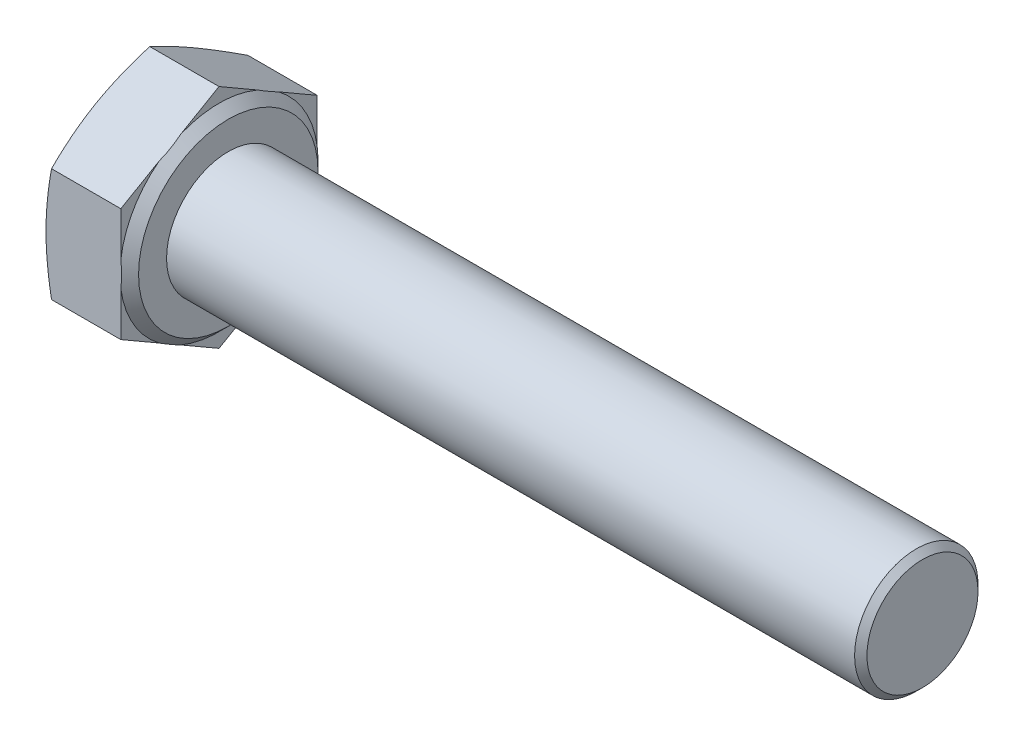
ISO-10303-21;
HEADER;
FILE_DESCRIPTION(('STEP AP214'),'2;1');
FILE_NAME('part.step','',(''),(''),'','','');
FILE_SCHEMA(('AUTOMOTIVE_DESIGN { 1 0 10303 214 1 1 1 1 }'));
ENDSEC;
DATA;
#1=APPLICATION_CONTEXT('core data for automotive mechanical design processes');
#2=APPLICATION_PROTOCOL_DEFINITION('international standard','automotive_design',2000,#1);
#3=PRODUCT_CONTEXT('',#1,'mechanical');
#4=PRODUCT('Part','Part','',(#3));
#5=PRODUCT_RELATED_PRODUCT_CATEGORY('part','',(#4));
#6=PRODUCT_DEFINITION_FORMATION('','',#4);
#7=PRODUCT_DEFINITION_CONTEXT('part definition',#1,'design');
#8=PRODUCT_DEFINITION('design','',#6,#7);
#9=PRODUCT_DEFINITION_SHAPE('','',#8);
#10=(LENGTH_UNIT() NAMED_UNIT(*) SI_UNIT(.MILLI.,.METRE.));
#11=(NAMED_UNIT(*) PLANE_ANGLE_UNIT() SI_UNIT($,.RADIAN.));
#12=(NAMED_UNIT(*) SI_UNIT($,.STERADIAN.) SOLID_ANGLE_UNIT());
#13=UNCERTAINTY_MEASURE_WITH_UNIT(LENGTH_MEASURE(1.E-05),#10,'distance_accuracy_value','');
#14=(GEOMETRIC_REPRESENTATION_CONTEXT(3) GLOBAL_UNCERTAINTY_ASSIGNED_CONTEXT((#13)) GLOBAL_UNIT_ASSIGNED_CONTEXT((#10,
#11,#12)) REPRESENTATION_CONTEXT('',''));
#15=CARTESIAN_POINT('',(0.,0.,0.));
#16=DIRECTION('',(0.,0.,1.));
#17=DIRECTION('',(1.,0.,0.));
#18=AXIS2_PLACEMENT_3D('',#15,#16,#17);
#19=CARTESIAN_POINT('',(5.45,-3.67483446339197,-6.365));
#20=DIRECTION('',(1.,0.,0.));
#21=DIRECTION('',(0.,0.,-1.));
#22=AXIS2_PLACEMENT_3D('',#19,#20,#21);
#23=PLANE('',#22);
#24=CARTESIAN_POINT('',(5.45,0.,0.));
#25=DIRECTION('',(-1.,0.,0.));
#26=DIRECTION('',(0.,0.,1.));
#27=AXIS2_PLACEMENT_3D('',#24,#25,#26);
#28=CIRCLE('',#27,5.815);
#29=CARTESIAN_POINT('',(5.45,0.,5.815));
#30=VERTEX_POINT('',#29);
#31=EDGE_CURVE('E342',#30,#30,#28,.T.);
#32=ORIENTED_EDGE('',*,*,#31,.F.);
#33=EDGE_LOOP('',(#32));
#34=FACE_BOUND('',#33,.T.);
#35=CARTESIAN_POINT('',(5.45,0.,0.));
#36=DIRECTION('',(1.,0.,0.));
#37=DIRECTION('',(0.,0.,-1.));
#38=AXIS2_PLACEMENT_3D('',#35,#36,#37);
#39=CIRCLE('',#38,4.);
#40=CARTESIAN_POINT('',(5.45,0.,4.));
#41=VERTEX_POINT('',#40);
#42=EDGE_CURVE('E345',#41,#41,#39,.T.);
#43=ORIENTED_EDGE('',*,*,#42,.F.);
#44=EDGE_LOOP('',(#43));
#45=FACE_BOUND('',#44,.T.);
#46=ADVANCED_FACE('F30',(#34,#45),#23,.T.);
#47=CARTESIAN_POINT('',(5.45,-7.34966892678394,0.));
#48=DIRECTION('',(0.,0.866025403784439,0.5));
#49=DIRECTION('',(0.,-0.5,0.866025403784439));
#50=AXIS2_PLACEMENT_3D('',#47,#48,#49);
#51=PLANE('',#50);
#52=CARTESIAN_POINT('',(0.358432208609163,-3.67471899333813,-6.3652));
#53=CARTESIAN_POINT('',(0.303017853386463,-3.82691148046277,-6.10159487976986));
#54=CARTESIAN_POINT('',(0.252608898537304,-3.9796058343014,-5.83712050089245));
#55=CARTESIAN_POINT('',(0.163922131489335,-4.28598738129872,-5.30645209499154));
#56=CARTESIAN_POINT('',(0.125653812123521,-4.43967525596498,-5.0402568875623));
#57=CARTESIAN_POINT('',(0.0637558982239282,-4.74633825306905,-4.50910099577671));
#58=CARTESIAN_POINT('',(0.0399912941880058,-4.8993063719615,-4.24415244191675));
#59=CARTESIAN_POINT('',(0.00811628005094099,-5.2056003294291,-3.71363574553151));
#60=CARTESIAN_POINT('',(0.,-5.35892601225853,-3.44806787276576));
#61=CARTESIAN_POINT('',(0.,-5.66557737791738,-2.91693212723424));
#62=CARTESIAN_POINT('',(0.00811628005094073,-5.81890306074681,-2.65136425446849));
#63=CARTESIAN_POINT('',(0.0399912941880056,-6.12519701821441,-2.12084755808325));
#64=CARTESIAN_POINT('',(0.0637558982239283,-6.27816513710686,-1.85589900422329));
#65=CARTESIAN_POINT('',(0.125653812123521,-6.58482813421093,-1.3247431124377));
#66=CARTESIAN_POINT('',(0.163922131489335,-6.73851600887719,-1.05854790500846));
#67=CARTESIAN_POINT('',(0.252608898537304,-7.04489755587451,-0.527879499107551));
#68=CARTESIAN_POINT('',(0.303017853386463,-7.19759190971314,-0.263405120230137));
#69=CARTESIAN_POINT('',(0.358432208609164,-7.34978439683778,0.000200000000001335));
#70=B_SPLINE_CURVE_WITH_KNOTS('',3,(#52,#53,#54,#55,#56,#57,#58,#59,#60,#61,#62,#63,#64,#65,#66,
#67,#68,#69),.UNSPECIFIED.,.F.,.F.,(4,2,2,2,2,2,2,2,4),(0.,0.928259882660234,1.85724379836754,
2.77744274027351,3.69729643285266,4.6171501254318,5.53734906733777,6.46633298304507,
7.39459286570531),.UNSPECIFIED.);
#71=CARTESIAN_POINT('',(0.358390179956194,-3.67483446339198,-6.365));
#72=VERTEX_POINT('',#71);
#73=CARTESIAN_POINT('',(0.,-5.51225169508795,-3.1825));
#74=VERTEX_POINT('',#73);
#75=EDGE_CURVE('E144',#72,#74,#70,.T.);
#76=ORIENTED_EDGE('',*,*,#75,.F.);
#77=DIRECTION('',(-1.,0.,0.));
#78=VECTOR('',#77,1.);
#79=CARTESIAN_POINT('',(5.45,-3.67483446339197,-6.365));
#80=LINE('',#79,#78);
#81=CARTESIAN_POINT('',(4.85,-3.67483446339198,-6.365));
#82=VERTEX_POINT('',#81);
#83=EDGE_CURVE('E173',#82,#72,#80,.T.);
#84=ORIENTED_EDGE('',*,*,#83,.F.);
#85=DIRECTION('',(0.,0.5,-0.866025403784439));
#86=VECTOR('',#85,1.);
#87=CARTESIAN_POINT('',(4.85,-7.34966892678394,0.));
#88=LINE('',#87,#86);
#89=CARTESIAN_POINT('',(4.85,-5.11256431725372,-3.87477884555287));
#90=VERTEX_POINT('',#89);
#91=EDGE_CURVE('E382',#90,#82,#88,.T.);
#92=ORIENTED_EDGE('',*,*,#91,.F.);
#93=CARTESIAN_POINT('',(4.8498,-5.91274078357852,-2.48883255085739));
#94=CARTESIAN_POINT('',(4.86645104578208,-5.84620990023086,-2.60406742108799));
#95=CARTESIAN_POINT('',(4.8790176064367,-5.77941769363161,-2.71975491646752));
#96=CARTESIAN_POINT('',(4.8957758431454,-5.64583354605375,-2.95112944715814));
#97=CARTESIAN_POINT('',(4.9,-5.57904262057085,-3.06681472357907));
#98=CARTESIAN_POINT('',(4.9,-5.44546076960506,-3.29818527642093));
#99=CARTESIAN_POINT('',(4.8957758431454,-5.37866984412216,-3.41387055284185));
#100=CARTESIAN_POINT('',(4.8790176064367,-5.2450856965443,-3.64524508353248));
#101=CARTESIAN_POINT('',(4.86645104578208,-5.17829348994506,-3.76093257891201));
#102=CARTESIAN_POINT('',(4.8498,-5.11176260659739,-3.87616744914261));
#103=B_SPLINE_CURVE_WITH_KNOTS('',3,(#93,#94,#95,#96,#97,#98,#99,#100,#101,#102),.UNSPECIFIED.,
.F.,.F.,(4,2,2,2,4),(0.,0.402253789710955,0.802938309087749,1.20362282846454,1.6058766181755),.UNSPECIFIED.);
#104=CARTESIAN_POINT('',(4.85,-5.91193907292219,-2.49022115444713));
#105=VERTEX_POINT('',#104);
#106=EDGE_CURVE('E279',#105,#90,#103,.T.);
#107=ORIENTED_EDGE('',*,*,#106,.F.);
#108=CARTESIAN_POINT('',(4.85,-7.34966892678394,0.));
#109=VERTEX_POINT('',#108);
#110=EDGE_CURVE('E387',#109,#105,#88,.T.);
#111=ORIENTED_EDGE('',*,*,#110,.F.);
#112=DIRECTION('',(-1.,0.,0.));
#113=VECTOR('',#112,1.);
#114=CARTESIAN_POINT('',(5.45,-7.34966892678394,0.));
#115=LINE('',#114,#113);
#116=CARTESIAN_POINT('',(0.358390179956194,-7.34966892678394,0.));
#117=VERTEX_POINT('',#116);
#118=EDGE_CURVE('E167',#109,#117,#115,.T.);
#119=ORIENTED_EDGE('',*,*,#118,.T.);
#120=EDGE_CURVE('E198',#74,#117,#70,.T.);
#121=ORIENTED_EDGE('',*,*,#120,.F.);
#122=EDGE_LOOP('',(#76,#84,#92,#107,#111,#119,#121));
#123=FACE_BOUND('',#122,.T.);
#124=ADVANCED_FACE('F213',(#123),#51,.F.);
#125=CARTESIAN_POINT('',(5.45,-3.67483446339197,-6.365));
#126=DIRECTION('',(0.,0.,1.));
#127=DIRECTION('',(0.,-1.,0.));
#128=AXIS2_PLACEMENT_3D('',#125,#126,#127);
#129=PLANE('',#128);
#130=CARTESIAN_POINT('',(1.9150953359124,-9.72967062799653,-6.365));
#131=CARTESIAN_POINT('',(1.82740685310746,-9.44169496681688,-6.365));
#132=CARTESIAN_POINT('',(1.74074158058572,-9.15340194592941,-6.365));
#133=CARTESIAN_POINT('',(1.57002349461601,-8.57601961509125,-6.365));
#134=CARTESIAN_POINT('',(1.48597088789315,-8.28693024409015,-6.365));
#135=CARTESIAN_POINT('',(1.320904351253,-7.70729883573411,-6.365));
#136=CARTESIAN_POINT('',(1.23989638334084,-7.41675509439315,-6.365));
#137=CARTESIAN_POINT('',(1.08186750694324,-6.83458682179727,-6.365));
#138=CARTESIAN_POINT('',(1.0048465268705,-6.54296231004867,-6.365));
#139=CARTESIAN_POINT('',(0.856698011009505,-5.96204179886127,-6.365));
#140=CARTESIAN_POINT('',(0.785509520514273,-5.67276142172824,-6.365));
#141=CARTESIAN_POINT('',(0.64919338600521,-5.09276117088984,-6.365));
#142=CARTESIAN_POINT('',(0.584065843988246,-4.80204127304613,-6.365));
#143=CARTESIAN_POINT('',(0.46138999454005,-4.21909692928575,-6.365));
#144=CARTESIAN_POINT('',(0.40383910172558,-3.92687303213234,-6.365));
#145=CARTESIAN_POINT('',(0.298068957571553,-3.34072867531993,-6.365));
#146=CARTESIAN_POINT('',(0.249849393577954,-3.04680827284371,-6.365));
#147=CARTESIAN_POINT('',(0.169475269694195,-2.49036754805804,-6.365));
#148=CARTESIAN_POINT('',(0.136125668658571,-2.22802146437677,-6.365));
#149=CARTESIAN_POINT('',(0.0796727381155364,-1.70221996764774,-6.365));
#150=CARTESIAN_POINT('',(0.0565691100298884,-1.43876458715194,-6.365));
#151=CARTESIAN_POINT('',(0.0217207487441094,-0.911278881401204,-6.365));
#152=CARTESIAN_POINT('',(0.00996798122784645,-0.64724909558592,-6.365));
#153=CARTESIAN_POINT('',(-0.00158361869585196,-0.11892536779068,-6.365));
#154=CARTESIAN_POINT('',(-0.00138253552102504,0.145368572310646,-6.365));
#155=CARTESIAN_POINT('',(0.0109939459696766,0.675012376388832,-6.365));
#156=CARTESIAN_POINT('',(0.0232300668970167,0.940360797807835,-6.365));
#157=CARTESIAN_POINT('',(0.0591135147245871,1.47027824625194,-6.365));
#158=CARTESIAN_POINT('',(0.0827611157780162,1.73484725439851,-6.365));
#159=CARTESIAN_POINT('',(0.14036130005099,2.26307523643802,-6.365));
#160=CARTESIAN_POINT('',(0.174322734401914,2.52673323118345,-6.365));
#161=CARTESIAN_POINT('',(0.251173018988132,3.0527302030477,-6.365));
#162=CARTESIAN_POINT('',(0.294061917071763,3.31506917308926,-6.365));
#163=CARTESIAN_POINT('',(0.389839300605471,3.85223310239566,-6.365));
#164=CARTESIAN_POINT('',(0.443136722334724,4.12698449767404,-6.365));
#165=CARTESIAN_POINT('',(0.556591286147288,4.67507636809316,-6.365));
#166=CARTESIAN_POINT('',(0.616748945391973,4.94841673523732,-6.365));
#167=CARTESIAN_POINT('',(0.742660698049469,5.49388136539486,-6.365));
#168=CARTESIAN_POINT('',(0.808416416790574,5.7660052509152,-6.365));
#169=CARTESIAN_POINT('',(0.944454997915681,6.30910658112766,-6.365));
#170=CARTESIAN_POINT('',(1.01473775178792,6.58008405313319,-6.365));
#171=CARTESIAN_POINT('',(1.15907513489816,7.1214003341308,-6.365));
#172=CARTESIAN_POINT('',(1.23313447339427,7.39173788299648,-6.365));
#173=CARTESIAN_POINT('',(1.38427063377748,7.93156975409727,-6.365));
#174=CARTESIAN_POINT('',(1.46134750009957,8.20106406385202,-6.365));
#175=CARTESIAN_POINT('',(1.69623888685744,9.00837522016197,-6.365));
#176=CARTESIAN_POINT('',(1.85774082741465,9.5451184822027,-6.365));
#177=CARTESIAN_POINT('',(2.18566531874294,10.6106004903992,-6.365));
#178=CARTESIAN_POINT('',(2.35201388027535,11.1393621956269,-6.365));
#179=CARTESIAN_POINT('',(2.68943698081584,12.1954003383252,-6.365));
#180=CARTESIAN_POINT('',(2.86051174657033,12.7226767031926,-6.365));
#181=CARTESIAN_POINT('',(3.20545948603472,13.7740950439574,-6.365));
#182=CARTESIAN_POINT('',(3.37931937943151,14.298241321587,-6.365));
#183=CARTESIAN_POINT('',(3.64203864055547,15.0837906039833,-6.365));
#184=CARTESIAN_POINT('',(3.72992971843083,15.3455181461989,-6.365));
#185=CARTESIAN_POINT('',(3.90628058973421,15.8687808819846,-6.365));
#186=CARTESIAN_POINT('',(3.99474038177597,16.1303160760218,-6.365));
#187=CARTESIAN_POINT('',(4.08344640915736,16.3917677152,-6.365));
#188=B_SPLINE_CURVE_WITH_KNOTS('',3,(#130,#131,#132,#133,#134,#135,#136,#137,#138,#139,#140,
#141,#142,#143,#144,#145,#146,#147,#148,#149,#150,#151,#152,#153,#154,#155,#156,#157,#158,#159,
#160,#161,#162,#163,#164,#165,#166,#167,#168,#169,#170,#171,#172,#173,#174,#175,#176,#177,#178,
#179,#180,#181,#182,#183,#184,#185,#186,#187),.UNSPECIFIED.,.F.,.F.,(4,2,2,2,2,2,2,2,2,2,2,2,2,
2,2,2,2,2,2,2,2,2,2,2,2,2,2,2,4),(0.,0.903097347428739,1.8062659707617,2.7111196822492,
3.61595714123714,4.50963841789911,5.4033347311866,6.29672529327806,7.19008591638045,
7.98328363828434,8.77645824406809,9.56907101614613,10.361678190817,11.1583050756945,
11.9549510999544,12.7522827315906,13.5496186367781,14.3891305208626,15.2287057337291,
16.0685255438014,16.9083252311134,17.7491990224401,18.5900852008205,20.271552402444,
21.9344598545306,23.5974472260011,25.2541246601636,26.0823966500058,26.9106666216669),.UNSPECIFIED.);
#189=CARTESIAN_POINT('',(0.358390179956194,3.67483446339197,-6.36500000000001));
#190=VERTEX_POINT('',#189);
#191=CARTESIAN_POINT('',(0.,0.,-6.365));
#192=VERTEX_POINT('',#191);
#193=EDGE_CURVE('E258',#190,#192,#188,.F.);
#194=ORIENTED_EDGE('',*,*,#193,.F.);
#195=DIRECTION('',(-1.,0.,0.));
#196=VECTOR('',#195,1.);
#197=CARTESIAN_POINT('',(5.45,3.67483446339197,-6.365));
#198=LINE('',#197,#196);
#199=CARTESIAN_POINT('',(4.85,3.67483446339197,-6.365));
#200=VERTEX_POINT('',#199);
#201=EDGE_CURVE('E164',#200,#190,#198,.T.);
#202=ORIENTED_EDGE('',*,*,#201,.F.);
#203=DIRECTION('',(0.,1.,0.));
#204=VECTOR('',#203,1.);
#205=CARTESIAN_POINT('',(4.85,-3.67483446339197,-6.365));
#206=LINE('',#205,#204);
#207=CARTESIAN_POINT('',(4.85,0.7993747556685,-6.365));
#208=VERTEX_POINT('',#207);
#209=EDGE_CURVE('E388',#208,#200,#206,.T.);
#210=ORIENTED_EDGE('',*,*,#209,.F.);
#211=CARTESIAN_POINT('',(4.03279951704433,-3.43387519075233,-6.365));
#212=CARTESIAN_POINT('',(4.12915263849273,-3.23085023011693,-6.365));
#213=CARTESIAN_POINT('',(4.22025748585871,-3.02511909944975,-6.365));
#214=CARTESIAN_POINT('',(4.38924442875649,-2.607586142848,-6.365));
#215=CARTESIAN_POINT('',(4.46708471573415,-2.39576749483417,-6.365));
#216=CARTESIAN_POINT('',(4.60570873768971,-1.96811964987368,-6.365));
#217=CARTESIAN_POINT('',(4.66660505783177,-1.75232760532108,-6.365));
#218=CARTESIAN_POINT('',(4.76875528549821,-1.31633465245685,-6.365));
#219=CARTESIAN_POINT('',(4.81003455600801,-1.09613982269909,-6.365));
#220=CARTESIAN_POINT('',(4.86166598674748,-0.716857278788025,-6.365));
#221=CARTESIAN_POINT('',(4.87750915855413,-0.558507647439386,-6.365));
#222=CARTESIAN_POINT('',(4.89740688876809,-0.241033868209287,-6.365));
#223=CARTESIAN_POINT('',(4.90146005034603,-0.0819096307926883,-6.365));
#224=CARTESIAN_POINT('',(4.89760366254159,0.236307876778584,-6.365));
#225=CARTESIAN_POINT('',(4.8896854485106,0.395401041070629,-6.365));
#226=CARTESIAN_POINT('',(4.86219166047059,0.712536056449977,-6.365));
#227=CARTESIAN_POINT('',(4.84261749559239,0.870578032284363,-6.365));
#228=CARTESIAN_POINT('',(4.77989629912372,1.26397857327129,-6.365));
#229=CARTESIAN_POINT('',(4.72984501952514,1.49825109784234,-6.365));
#230=CARTESIAN_POINT('',(4.60840439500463,1.96142866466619,-6.365));
#231=CARTESIAN_POINT('',(4.53698240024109,2.19032491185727,-6.365));
#232=CARTESIAN_POINT('',(4.37639278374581,2.64284924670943,-6.365));
#233=CARTESIAN_POINT('',(4.28714977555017,2.86645027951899,-6.365));
#234=CARTESIAN_POINT('',(4.14298757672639,3.1968115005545,-6.365));
#235=CARTESIAN_POINT('',(4.09331043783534,3.30591051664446,-6.365));
#236=CARTESIAN_POINT('',(3.99087238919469,3.52261302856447,-6.365));
#237=CARTESIAN_POINT('',(3.93811240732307,3.63021696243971,-6.365));
#238=CARTESIAN_POINT('',(3.88398571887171,3.73713082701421,-6.365));
#239=B_SPLINE_CURVE_WITH_KNOTS('',3,(#211,#212,#213,#214,#215,#216,#217,#218,#219,#220,#221,
#222,#223,#224,#225,#226,#227,#228,#229,#230,#231,#232,#233,#234,#235,#236,#237,#238),
.UNSPECIFIED.,.F.,.F.,(4,2,2,2,2,2,2,2,2,2,2,2,2,4),(0.,0.67440515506,1.35089815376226,
2.02278254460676,2.69379587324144,3.17081389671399,3.64788843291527,4.1253084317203,
4.60267072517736,5.32008921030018,6.03860940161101,6.76023604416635,7.11982798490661,
7.47931224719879),.UNSPECIFIED.);
#240=CARTESIAN_POINT('',(4.85,-0.799374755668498,-6.365));
#241=VERTEX_POINT('',#240);
#242=EDGE_CURVE('E273',#241,#208,#239,.T.);
#243=ORIENTED_EDGE('',*,*,#242,.F.);
#244=EDGE_CURVE('E384',#82,#241,#206,.T.);
#245=ORIENTED_EDGE('',*,*,#244,.F.);
#246=ORIENTED_EDGE('',*,*,#83,.T.);
#247=EDGE_CURVE('E155',#192,#72,#188,.F.);
#248=ORIENTED_EDGE('',*,*,#247,.F.);
#249=EDGE_LOOP('',(#194,#202,#210,#243,#245,#246,#248));
#250=FACE_BOUND('',#249,.T.);
#251=ADVANCED_FACE('F265',(#250),#129,.F.);
#252=CARTESIAN_POINT('',(5.45,3.67483446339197,-6.365));
#253=DIRECTION('',(0.,-0.866025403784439,0.5));
#254=DIRECTION('',(0.,-0.5,-0.866025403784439));
#255=AXIS2_PLACEMENT_3D('',#252,#253,#254);
#256=PLANE('',#255);
#257=CARTESIAN_POINT('',(0.358432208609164,7.34978439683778,0.000200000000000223));
#258=CARTESIAN_POINT('',(0.303017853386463,7.19759190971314,-0.263405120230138));
#259=CARTESIAN_POINT('',(0.252608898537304,7.04489755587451,-0.527879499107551));
#260=CARTESIAN_POINT('',(0.163922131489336,6.73851600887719,-1.05854790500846));
#261=CARTESIAN_POINT('',(0.125653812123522,6.58482813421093,-1.3247431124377));
#262=CARTESIAN_POINT('',(0.0637558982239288,6.27816513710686,-1.85589900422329));
#263=CARTESIAN_POINT('',(0.0399912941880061,6.12519701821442,-2.12084755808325));
#264=CARTESIAN_POINT('',(0.00811628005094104,5.81890306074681,-2.65136425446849));
#265=CARTESIAN_POINT('',(0.,5.66557737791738,-2.91693212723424));
#266=CARTESIAN_POINT('',(0.,5.35892601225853,-3.44806787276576));
#267=CARTESIAN_POINT('',(0.00811628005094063,5.2056003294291,-3.71363574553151));
#268=CARTESIAN_POINT('',(0.0399912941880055,4.8993063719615,-4.24415244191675));
#269=CARTESIAN_POINT('',(0.0637558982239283,4.74633825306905,-4.50910099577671));
#270=CARTESIAN_POINT('',(0.125653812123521,4.43967525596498,-5.0402568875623));
#271=CARTESIAN_POINT('',(0.163922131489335,4.28598738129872,-5.30645209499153));
#272=CARTESIAN_POINT('',(0.252608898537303,3.9796058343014,-5.83712050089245));
#273=CARTESIAN_POINT('',(0.303017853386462,3.82691148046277,-6.10159487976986));
#274=CARTESIAN_POINT('',(0.358432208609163,3.67471899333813,-6.3652));
#275=B_SPLINE_CURVE_WITH_KNOTS('',3,(#257,#258,#259,#260,#261,#262,#263,#264,#265,#266,#267,
#268,#269,#270,#271,#272,#273,#274),.UNSPECIFIED.,.F.,.F.,(4,2,2,2,2,2,2,2,4),(0.,
0.928259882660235,1.85724379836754,2.77744274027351,3.69729643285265,4.6171501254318,
5.53734906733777,6.46633298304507,7.39459286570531),.UNSPECIFIED.);
#276=CARTESIAN_POINT('',(0.358390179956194,7.34966892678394,0.));
#277=VERTEX_POINT('',#276);
#278=CARTESIAN_POINT('',(0.,5.51225169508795,-3.1825));
#279=VERTEX_POINT('',#278);
#280=EDGE_CURVE('E45',#277,#279,#275,.T.);
#281=ORIENTED_EDGE('',*,*,#280,.F.);
#282=DIRECTION('',(-1.,0.,0.));
#283=VECTOR('',#282,1.);
#284=CARTESIAN_POINT('',(5.45,7.34966892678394,0.));
#285=LINE('',#284,#283);
#286=CARTESIAN_POINT('',(4.85,7.34966892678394,0.));
#287=VERTEX_POINT('',#286);
#288=EDGE_CURVE('E161',#287,#277,#285,.T.);
#289=ORIENTED_EDGE('',*,*,#288,.F.);
#290=DIRECTION('',(0.,0.5,0.866025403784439));
#291=VECTOR('',#290,1.);
#292=CARTESIAN_POINT('',(4.85,3.67483446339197,-6.365));
#293=LINE('',#292,#291);
#294=CARTESIAN_POINT('',(4.85,5.91193907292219,-2.49022115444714));
#295=VERTEX_POINT('',#294);
#296=EDGE_CURVE('E412',#295,#287,#293,.T.);
#297=ORIENTED_EDGE('',*,*,#296,.F.);
#298=CARTESIAN_POINT('',(4.8498,5.11176260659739,-3.87616744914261));
#299=CARTESIAN_POINT('',(4.86645104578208,5.17829348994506,-3.76093257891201));
#300=CARTESIAN_POINT('',(4.8790176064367,5.2450856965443,-3.64524508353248));
#301=CARTESIAN_POINT('',(4.8957758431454,5.37866984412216,-3.41387055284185));
#302=CARTESIAN_POINT('',(4.9,5.44546076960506,-3.29818527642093));
#303=CARTESIAN_POINT('',(4.9,5.57904262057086,-3.06681472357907));
#304=CARTESIAN_POINT('',(4.8957758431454,5.64583354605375,-2.95112944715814));
#305=CARTESIAN_POINT('',(4.8790176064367,5.77941769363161,-2.71975491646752));
#306=CARTESIAN_POINT('',(4.86645104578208,5.84620990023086,-2.60406742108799));
#307=CARTESIAN_POINT('',(4.8498,5.91274078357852,-2.48883255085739));
#308=B_SPLINE_CURVE_WITH_KNOTS('',3,(#298,#299,#300,#301,#302,#303,#304,#305,#306,#307),
.UNSPECIFIED.,.F.,.F.,(4,2,2,2,4),(0.,0.402253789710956,0.80293830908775,1.20362282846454,
1.6058766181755),.UNSPECIFIED.);
#309=CARTESIAN_POINT('',(4.85,5.11256431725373,-3.87477884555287));
#310=VERTEX_POINT('',#309);
#311=EDGE_CURVE('E280',#310,#295,#308,.T.);
#312=ORIENTED_EDGE('',*,*,#311,.F.);
#313=EDGE_CURVE('E407',#200,#310,#293,.T.);
#314=ORIENTED_EDGE('',*,*,#313,.F.);
#315=ORIENTED_EDGE('',*,*,#201,.T.);
#316=EDGE_CURVE('E259',#279,#190,#275,.T.);
#317=ORIENTED_EDGE('',*,*,#316,.F.);
#318=EDGE_LOOP('',(#281,#289,#297,#312,#314,#315,#317));
#319=FACE_BOUND('',#318,.T.);
#320=ADVANCED_FACE('F268',(#319),#256,.F.);
#321=CARTESIAN_POINT('',(5.45,7.34966892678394,0.));
#322=DIRECTION('',(0.,-0.866025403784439,-0.5));
#323=DIRECTION('',(0.,0.5,-0.866025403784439));
#324=AXIS2_PLACEMENT_3D('',#321,#322,#323);
#325=PLANE('',#324);
#326=CARTESIAN_POINT('',(0.358432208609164,3.67471899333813,6.3652));
#327=CARTESIAN_POINT('',(0.303017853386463,3.82691148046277,6.10159487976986));
#328=CARTESIAN_POINT('',(0.252608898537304,3.9796058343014,5.83712050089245));
#329=CARTESIAN_POINT('',(0.163922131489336,4.28598738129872,5.30645209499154));
#330=CARTESIAN_POINT('',(0.125653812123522,4.43967525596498,5.0402568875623));
#331=CARTESIAN_POINT('',(0.0637558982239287,4.74633825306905,4.50910099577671));
#332=CARTESIAN_POINT('',(0.0399912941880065,4.8993063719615,4.24415244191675));
#333=CARTESIAN_POINT('',(0.00811628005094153,5.2056003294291,3.71363574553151));
#334=CARTESIAN_POINT('',(0.,5.35892601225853,3.44806787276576));
#335=CARTESIAN_POINT('',(0.,5.66557737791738,2.91693212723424));
#336=CARTESIAN_POINT('',(0.0081162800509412,5.81890306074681,2.65136425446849));
#337=CARTESIAN_POINT('',(0.0399912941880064,6.12519701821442,2.12084755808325));
#338=CARTESIAN_POINT('',(0.0637558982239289,6.27816513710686,1.85589900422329));
#339=CARTESIAN_POINT('',(0.125653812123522,6.58482813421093,1.3247431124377));
#340=CARTESIAN_POINT('',(0.163922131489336,6.73851600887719,1.05854790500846));
#341=CARTESIAN_POINT('',(0.252608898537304,7.04489755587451,0.527879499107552));
#342=CARTESIAN_POINT('',(0.303017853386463,7.19759190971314,0.263405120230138));
#343=CARTESIAN_POINT('',(0.358432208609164,7.34978439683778,-0.00020000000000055));
#344=B_SPLINE_CURVE_WITH_KNOTS('',3,(#326,#327,#328,#329,#330,#331,#332,#333,#334,#335,#336,
#337,#338,#339,#340,#341,#342,#343),.UNSPECIFIED.,.F.,.F.,(4,2,2,2,2,2,2,2,4),(0.,
0.928259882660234,1.85724379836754,2.77744274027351,3.69729643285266,4.6171501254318,
5.53734906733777,6.46633298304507,7.39459286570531),.UNSPECIFIED.);
#345=CARTESIAN_POINT('',(0.358390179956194,3.67483446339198,6.365));
#346=VERTEX_POINT('',#345);
#347=CARTESIAN_POINT('',(0.,5.51225169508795,3.1825));
#348=VERTEX_POINT('',#347);
#349=EDGE_CURVE('E53',#346,#348,#344,.T.);
#350=ORIENTED_EDGE('',*,*,#349,.F.);
#351=DIRECTION('',(-1.,0.,0.));
#352=VECTOR('',#351,1.);
#353=CARTESIAN_POINT('',(5.45,3.67483446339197,6.365));
#354=LINE('',#353,#352);
#355=CARTESIAN_POINT('',(4.85,3.67483446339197,6.365));
#356=VERTEX_POINT('',#355);
#357=EDGE_CURVE('E152',#356,#346,#354,.T.);
#358=ORIENTED_EDGE('',*,*,#357,.F.);
#359=DIRECTION('',(0.,-0.5,0.866025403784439));
#360=VECTOR('',#359,1.);
#361=CARTESIAN_POINT('',(4.85,7.34966892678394,0.));
#362=LINE('',#361,#360);
#363=CARTESIAN_POINT('',(4.85,5.11256431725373,3.87477884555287));
#364=VERTEX_POINT('',#363);
#365=EDGE_CURVE('E419',#364,#356,#362,.T.);
#366=ORIENTED_EDGE('',*,*,#365,.F.);
#367=CARTESIAN_POINT('',(4.8498,5.91274078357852,2.48883255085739));
#368=CARTESIAN_POINT('',(4.86645104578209,5.84620990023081,2.60406742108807));
#369=CARTESIAN_POINT('',(4.87901760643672,5.77941769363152,2.71975491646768));
#370=CARTESIAN_POINT('',(4.89577584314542,5.64583354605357,2.95112944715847));
#371=CARTESIAN_POINT('',(4.90000000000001,5.57904262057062,3.06681472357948));
#372=CARTESIAN_POINT('',(4.89999999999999,5.44546076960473,3.29818527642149));
#373=CARTESIAN_POINT('',(4.89577584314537,5.37866984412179,3.4138705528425));
#374=CARTESIAN_POINT('',(4.87901760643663,5.24508569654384,3.64524508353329));
#375=CARTESIAN_POINT('',(4.86645104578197,5.17829348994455,3.7609325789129));
#376=CARTESIAN_POINT('',(4.84979999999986,5.11176260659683,3.87616744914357));
#377=B_SPLINE_CURVE_WITH_KNOTS('',3,(#367,#368,#369,#370,#371,#372,#373,#374,#375,#376),
.UNSPECIFIED.,.F.,.F.,(4,2,2,2,4),(0.,0.402253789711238,0.802938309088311,1.20362282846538,
1.60587661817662),.UNSPECIFIED.);
#378=CARTESIAN_POINT('',(4.85,5.91193907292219,2.49022115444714));
#379=VERTEX_POINT('',#378);
#380=EDGE_CURVE('E312',#379,#364,#377,.T.);
#381=ORIENTED_EDGE('',*,*,#380,.F.);
#382=EDGE_CURVE('E418',#287,#379,#362,.T.);
#383=ORIENTED_EDGE('',*,*,#382,.F.);
#384=ORIENTED_EDGE('',*,*,#288,.T.);
#385=EDGE_CURVE('E154',#348,#277,#344,.T.);
#386=ORIENTED_EDGE('',*,*,#385,.F.);
#387=EDGE_LOOP('',(#350,#358,#366,#381,#383,#384,#386));
#388=FACE_BOUND('',#387,.T.);
#389=ADVANCED_FACE('F150',(#388),#325,.F.);
#390=CARTESIAN_POINT('',(5.45,3.67483446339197,6.365));
#391=DIRECTION('',(0.,0.,-1.));
#392=DIRECTION('',(-1.,0.,0.));
#393=AXIS2_PLACEMENT_3D('',#390,#391,#392);
#394=PLANE('',#393);
#395=CARTESIAN_POINT('',(1.91509499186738,-9.72966949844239,6.365));
#396=CARTESIAN_POINT('',(1.8274065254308,-9.44169388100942,6.365));
#397=CARTESIAN_POINT('',(1.74074126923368,-9.15340090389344,6.365));
#398=CARTESIAN_POINT('',(1.57002321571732,-8.57601866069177,6.365));
#399=CARTESIAN_POINT('',(1.48597062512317,-8.28692933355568,6.365));
#400=CARTESIAN_POINT('',(1.32090412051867,-7.70729801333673,6.365));
#401=CARTESIAN_POINT('',(1.23989616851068,-7.41675431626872,6.365));
#402=CARTESIAN_POINT('',(1.08186732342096,-6.83458613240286,6.365));
#403=CARTESIAN_POINT('',(1.00484635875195,-6.54296166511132,6.365));
#404=CARTESIAN_POINT('',(0.856697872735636,-5.96204124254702,6.365));
#405=CARTESIAN_POINT('',(0.785509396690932,-5.67276090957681,6.365));
#406=CARTESIAN_POINT('',(0.64919328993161,-5.09276074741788,6.365));
#407=CARTESIAN_POINT('',(0.584065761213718,-4.80204089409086,6.365));
#408=CARTESIAN_POINT('',(0.461389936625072,-4.21909663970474,6.365));
#409=CARTESIAN_POINT('',(0.403839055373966,-3.92687278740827,6.365));
#410=CARTESIAN_POINT('',(0.2980689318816,-3.34072852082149,6.365));
#411=CARTESIAN_POINT('',(0.249849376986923,-3.04680816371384,6.365));
#412=CARTESIAN_POINT('',(0.169475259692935,-2.49036747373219,6.365));
#413=CARTESIAN_POINT('',(0.136125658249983,-2.22802137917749,6.365));
#414=CARTESIAN_POINT('',(0.0796727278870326,-1.7022198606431,6.365));
#415=CARTESIAN_POINT('',(0.0565691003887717,-1.43876446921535,6.365));
#416=CARTESIAN_POINT('',(0.021720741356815,-0.911278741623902,6.365));
#417=CARTESIAN_POINT('',(0.00996797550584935,-0.647248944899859,6.365));
#418=CARTESIAN_POINT('',(-0.00158362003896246,-0.118925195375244,6.365));
#419=CARTESIAN_POINT('',(-0.00138253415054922,0.145368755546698,6.365));
#420=CARTESIAN_POINT('',(0.0109939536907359,0.675012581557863,6.365));
#421=CARTESIAN_POINT('',(0.0232300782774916,0.940361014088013,6.365));
#422=CARTESIAN_POINT('',(0.05911353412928,1.4702784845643,6.365));
#423=CARTESIAN_POINT('',(0.0827611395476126,1.7348475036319,6.365));
#424=CARTESIAN_POINT('',(0.140361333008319,2.26307550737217,6.365));
#425=CARTESIAN_POINT('',(0.174322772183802,2.52673351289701,6.365));
#426=CARTESIAN_POINT('',(0.251173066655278,3.05273050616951,6.365));
#427=CARTESIAN_POINT('',(0.294061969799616,3.3150694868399,6.365));
#428=CARTESIAN_POINT('',(0.389839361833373,3.85223342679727,6.365));
#429=CARTESIAN_POINT('',(0.443136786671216,4.1269848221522,6.365));
#430=CARTESIAN_POINT('',(0.556591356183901,4.6750766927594,6.365));
#431=CARTESIAN_POINT('',(0.616749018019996,4.94841706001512,6.365));
#432=CARTESIAN_POINT('',(0.742660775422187,5.49388169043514,6.365));
#433=CARTESIAN_POINT('',(0.808416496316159,5.76600557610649,6.365));
#434=CARTESIAN_POINT('',(0.944455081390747,6.30910690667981,6.365));
#435=CARTESIAN_POINT('',(1.01473783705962,6.58008437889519,6.365));
#436=CARTESIAN_POINT('',(1.15907522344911,7.12140066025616,6.365));
#437=CARTESIAN_POINT('',(1.23313456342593,7.39173820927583,6.365));
#438=CARTESIAN_POINT('',(1.38427072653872,7.93157008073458,6.365));
#439=CARTESIAN_POINT('',(1.46134759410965,8.20106439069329,6.365));
#440=CARTESIAN_POINT('',(1.6962389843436,9.00837554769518,6.365));
#441=CARTESIAN_POINT('',(1.85774092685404,9.54511881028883,6.365));
#442=CARTESIAN_POINT('',(2.18566542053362,10.6106008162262,6.365));
#443=CARTESIAN_POINT('',(2.35201398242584,11.1393625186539,6.365));
#444=CARTESIAN_POINT('',(2.6894370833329,12.1954006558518,6.365));
#445=CARTESIAN_POINT('',(2.86051184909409,12.7226770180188,6.365));
#446=CARTESIAN_POINT('',(3.2054595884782,13.7740953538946,6.365));
#447=CARTESIAN_POINT('',(3.37931948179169,14.2982416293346,6.365));
#448=CARTESIAN_POINT('',(3.64203874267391,15.0837909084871,6.365));
#449=CARTESIAN_POINT('',(3.72992982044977,15.3455184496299,6.365));
#450=CARTESIAN_POINT('',(3.90628069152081,15.8687811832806,6.365));
#451=CARTESIAN_POINT('',(3.99474048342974,16.1303163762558,6.365));
#452=CARTESIAN_POINT('',(4.08344651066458,16.3917680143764,6.365));
#453=B_SPLINE_CURVE_WITH_KNOTS('',3,(#395,#396,#397,#398,#399,#400,#401,#402,#403,#404,#405,
#406,#407,#408,#409,#410,#411,#412,#413,#414,#415,#416,#417,#418,#419,#420,#421,#422,#423,#424,
#425,#426,#427,#428,#429,#430,#431,#432,#433,#434,#435,#436,#437,#438,#439,#440,#441,#442,#443,
#444,#445,#446,#447,#448,#449,#450,#451,#452),.UNSPECIFIED.,.F.,.F.,(4,2,2,2,2,2,2,2,2,2,2,2,2,
2,2,2,2,2,2,2,2,2,2,2,2,2,2,2,4),(0.,0.903097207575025,1.80626569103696,2.71111926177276,
3.61595658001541,4.50963771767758,5.40333389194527,6.29672431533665,7.19008479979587,
7.98328255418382,8.77645719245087,9.56906999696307,10.3616772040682,11.1583041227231,
11.9549501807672,12.7522818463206,13.5496177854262,14.3891296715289,15.2287048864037,
16.0685246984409,16.9083243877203,17.7491981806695,18.5900843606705,20.2715515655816,
21.9344590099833,23.5974463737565,25.2541238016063,26.0823957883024,26.9106657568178),.UNSPECIFIED.);
#454=CARTESIAN_POINT('',(0.358390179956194,-3.67483446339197,6.36500000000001));
#455=VERTEX_POINT('',#454);
#456=CARTESIAN_POINT('',(0.,0.,6.365));
#457=VERTEX_POINT('',#456);
#458=EDGE_CURVE('E146',#455,#457,#453,.T.);
#459=ORIENTED_EDGE('',*,*,#458,.F.);
#460=DIRECTION('',(-1.,0.,0.));
#461=VECTOR('',#460,1.);
#462=CARTESIAN_POINT('',(5.45,-3.67483446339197,6.365));
#463=LINE('',#462,#461);
#464=CARTESIAN_POINT('',(4.85,-3.67483446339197,6.36500000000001));
#465=VERTEX_POINT('',#464);
#466=EDGE_CURVE('E162',#465,#455,#463,.T.);
#467=ORIENTED_EDGE('',*,*,#466,.F.);
#468=DIRECTION('',(0.,-1.,0.));
#469=VECTOR('',#468,1.);
#470=CARTESIAN_POINT('',(4.85,3.67483446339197,6.365));
#471=LINE('',#470,#469);
#472=CARTESIAN_POINT('',(4.85,-0.799374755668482,6.365));
#473=VERTEX_POINT('',#472);
#474=EDGE_CURVE('E359',#473,#465,#471,.T.);
#475=ORIENTED_EDGE('',*,*,#474,.F.);
#476=CARTESIAN_POINT('',(4.03279951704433,-3.43387519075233,6.365));
#477=CARTESIAN_POINT('',(4.12915263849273,-3.23085023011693,6.365));
#478=CARTESIAN_POINT('',(4.22025748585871,-3.02511909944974,6.365));
#479=CARTESIAN_POINT('',(4.38924442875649,-2.607586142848,6.365));
#480=CARTESIAN_POINT('',(4.46708471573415,-2.39576749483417,6.365));
#481=CARTESIAN_POINT('',(4.60570873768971,-1.96811964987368,6.365));
#482=CARTESIAN_POINT('',(4.66660505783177,-1.75232760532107,6.365));
#483=CARTESIAN_POINT('',(4.76875528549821,-1.31633465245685,6.365));
#484=CARTESIAN_POINT('',(4.81003455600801,-1.09613982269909,6.365));
#485=CARTESIAN_POINT('',(4.86166598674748,-0.716857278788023,6.365));
#486=CARTESIAN_POINT('',(4.87750915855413,-0.558507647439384,6.365));
#487=CARTESIAN_POINT('',(4.89740688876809,-0.241033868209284,6.365));
#488=CARTESIAN_POINT('',(4.90146005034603,-0.0819096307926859,6.365));
#489=CARTESIAN_POINT('',(4.89760366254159,0.236307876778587,6.365));
#490=CARTESIAN_POINT('',(4.8896854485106,0.395401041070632,6.365));
#491=CARTESIAN_POINT('',(4.86219166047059,0.712536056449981,6.365));
#492=CARTESIAN_POINT('',(4.84261749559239,0.870578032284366,6.365));
#493=CARTESIAN_POINT('',(4.77989629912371,1.26397857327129,6.365));
#494=CARTESIAN_POINT('',(4.72984501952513,1.49825109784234,6.365));
#495=CARTESIAN_POINT('',(4.60840439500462,1.9614286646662,6.365));
#496=CARTESIAN_POINT('',(4.53698240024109,2.19032491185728,6.365));
#497=CARTESIAN_POINT('',(4.37639278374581,2.64284924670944,6.365));
#498=CARTESIAN_POINT('',(4.28714977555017,2.866450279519,6.365));
#499=CARTESIAN_POINT('',(4.14298757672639,3.1968115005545,6.365));
#500=CARTESIAN_POINT('',(4.09331043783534,3.30591051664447,6.365));
#501=CARTESIAN_POINT('',(3.99087238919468,3.52261302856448,6.365));
#502=CARTESIAN_POINT('',(3.93811240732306,3.63021696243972,6.365));
#503=CARTESIAN_POINT('',(3.88398571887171,3.73713082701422,6.365));
#504=B_SPLINE_CURVE_WITH_KNOTS('',3,(#476,#477,#478,#479,#480,#481,#482,#483,#484,#485,#486,
#487,#488,#489,#490,#491,#492,#493,#494,#495,#496,#497,#498,#499,#500,#501,#502,#503),
.UNSPECIFIED.,.F.,.F.,(4,2,2,2,2,2,2,2,2,2,2,2,2,4),(0.,0.67440515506,1.35089815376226,
2.02278254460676,2.69379587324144,3.17081389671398,3.64788843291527,4.1253084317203,
4.60267072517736,5.32008921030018,6.03860940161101,6.76023604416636,7.11982798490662,
7.47931224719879),.UNSPECIFIED.);
#505=CARTESIAN_POINT('',(4.85,0.799374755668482,6.365));
#506=VERTEX_POINT('',#505);
#507=EDGE_CURVE('E307',#506,#473,#504,.F.);
#508=ORIENTED_EDGE('',*,*,#507,.F.);
#509=EDGE_CURVE('E160',#356,#506,#471,.T.);
#510=ORIENTED_EDGE('',*,*,#509,.F.);
#511=ORIENTED_EDGE('',*,*,#357,.T.);
#512=EDGE_CURVE('E136',#457,#346,#453,.T.);
#513=ORIENTED_EDGE('',*,*,#512,.F.);
#514=EDGE_LOOP('',(#459,#467,#475,#508,#510,#511,#513));
#515=FACE_BOUND('',#514,.T.);
#516=ADVANCED_FACE('F158',(#515),#394,.F.);
#517=CARTESIAN_POINT('',(5.45,-3.67483446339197,6.365));
#518=DIRECTION('',(0.,0.866025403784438,-0.5));
#519=DIRECTION('',(0.,0.5,0.866025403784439));
#520=AXIS2_PLACEMENT_3D('',#517,#518,#519);
#521=PLANE('',#520);
#522=CARTESIAN_POINT('',(0.358432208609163,-7.34978439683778,-0.00019999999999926));
#523=CARTESIAN_POINT('',(0.303017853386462,-7.19759190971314,0.263405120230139));
#524=CARTESIAN_POINT('',(0.252608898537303,-7.04489755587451,0.527879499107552));
#525=CARTESIAN_POINT('',(0.163922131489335,-6.73851600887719,1.05854790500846));
#526=CARTESIAN_POINT('',(0.125653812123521,-6.58482813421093,1.3247431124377));
#527=CARTESIAN_POINT('',(0.0637558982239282,-6.27816513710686,1.85589900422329));
#528=CARTESIAN_POINT('',(0.0399912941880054,-6.12519701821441,2.12084755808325));
#529=CARTESIAN_POINT('',(0.00811628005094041,-5.81890306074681,2.65136425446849));
#530=CARTESIAN_POINT('',(0.,-5.66557737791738,2.91693212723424));
#531=CARTESIAN_POINT('',(0.,-5.35892601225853,3.44806787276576));
#532=CARTESIAN_POINT('',(0.00811628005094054,-5.2056003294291,3.71363574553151));
#533=CARTESIAN_POINT('',(0.0399912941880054,-4.89930637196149,4.24415244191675));
#534=CARTESIAN_POINT('',(0.0637558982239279,-4.74633825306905,4.50910099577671));
#535=CARTESIAN_POINT('',(0.125653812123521,-4.43967525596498,5.0402568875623));
#536=CARTESIAN_POINT('',(0.163922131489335,-4.28598738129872,5.30645209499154));
#537=CARTESIAN_POINT('',(0.252608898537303,-3.9796058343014,5.83712050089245));
#538=CARTESIAN_POINT('',(0.303017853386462,-3.82691148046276,6.10159487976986));
#539=CARTESIAN_POINT('',(0.358432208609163,-3.67471899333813,6.3652));
#540=B_SPLINE_CURVE_WITH_KNOTS('',3,(#522,#523,#524,#525,#526,#527,#528,#529,#530,#531,#532,
#533,#534,#535,#536,#537,#538,#539),.UNSPECIFIED.,.F.,.F.,(4,2,2,2,2,2,2,2,4),(0.,
0.928259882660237,1.85724379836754,2.77744274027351,3.69729643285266,4.6171501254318,
5.53734906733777,6.46633298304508,7.39459286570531),.UNSPECIFIED.);
#541=CARTESIAN_POINT('',(0.,-5.51225169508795,3.1825));
#542=VERTEX_POINT('',#541);
#543=EDGE_CURVE('E200',#117,#542,#540,.T.);
#544=ORIENTED_EDGE('',*,*,#543,.F.);
#545=ORIENTED_EDGE('',*,*,#118,.F.);
#546=DIRECTION('',(0.,-0.5,-0.866025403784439));
#547=VECTOR('',#546,1.);
#548=CARTESIAN_POINT('',(4.85,-3.67483446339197,6.365));
#549=LINE('',#548,#547);
#550=CARTESIAN_POINT('',(4.85,-5.91193907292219,2.49022115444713));
#551=VERTEX_POINT('',#550);
#552=EDGE_CURVE('E176',#551,#109,#549,.T.);
#553=ORIENTED_EDGE('',*,*,#552,.F.);
#554=CARTESIAN_POINT('',(4.84979999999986,-5.11176260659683,3.87616744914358));
#555=CARTESIAN_POINT('',(4.86645104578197,-5.17829348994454,3.76093257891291));
#556=CARTESIAN_POINT('',(4.87901760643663,-5.24508569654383,3.64524508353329));
#557=CARTESIAN_POINT('',(4.89577584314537,-5.37866984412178,3.4138705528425));
#558=CARTESIAN_POINT('',(4.89999999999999,-5.44546076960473,3.2981852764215));
#559=CARTESIAN_POINT('',(4.90000000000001,-5.57904262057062,3.06681472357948));
#560=CARTESIAN_POINT('',(4.89577584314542,-5.64583354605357,2.95112944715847));
#561=CARTESIAN_POINT('',(4.87901760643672,-5.77941769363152,2.71975491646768));
#562=CARTESIAN_POINT('',(4.86645104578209,-5.84620990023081,2.60406742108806));
#563=CARTESIAN_POINT('',(4.8498,-5.91274078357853,2.48883255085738));
#564=B_SPLINE_CURVE_WITH_KNOTS('',3,(#554,#555,#556,#557,#558,#559,#560,#561,#562,#563),
.UNSPECIFIED.,.F.,.F.,(4,2,2,2,4),(0.,0.402253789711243,0.802938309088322,1.2036228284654,
1.60587661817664),.UNSPECIFIED.);
#565=CARTESIAN_POINT('',(4.85,-5.11256431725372,3.87477884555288));
#566=VERTEX_POINT('',#565);
#567=EDGE_CURVE('E299',#566,#551,#564,.T.);
#568=ORIENTED_EDGE('',*,*,#567,.F.);
#569=EDGE_CURVE('E178',#465,#566,#549,.T.);
#570=ORIENTED_EDGE('',*,*,#569,.F.);
#571=ORIENTED_EDGE('',*,*,#466,.T.);
#572=EDGE_CURVE('E245',#542,#455,#540,.T.);
#573=ORIENTED_EDGE('',*,*,#572,.F.);
#574=EDGE_LOOP('',(#544,#545,#553,#568,#570,#571,#573));
#575=FACE_BOUND('',#574,.T.);
#576=ADVANCED_FACE('F321',(#575),#521,.F.);
#577=CARTESIAN_POINT('',(4.85,6.415,0.));
#578=DIRECTION('',(1.,0.,0.));
#579=DIRECTION('',(0.,0.,-1.));
#580=AXIS2_PLACEMENT_3D('',#577,#578,#579);
#581=PLANE('',#580);
#582=ORIENTED_EDGE('',*,*,#91,.T.);
#583=ORIENTED_EDGE('',*,*,#244,.T.);
#584=CARTESIAN_POINT('',(4.85,0.,0.));
#585=DIRECTION('',(-1.,0.,0.));
#586=DIRECTION('',(0.,0.,1.));
#587=AXIS2_PLACEMENT_3D('',#584,#585,#586);
#588=CIRCLE('',#587,6.415);
#589=EDGE_CURVE('E365',#241,#90,#588,.T.);
#590=ORIENTED_EDGE('',*,*,#589,.T.);
#591=EDGE_LOOP('',(#582,#583,#590));
#592=FACE_BOUND('',#591,.T.);
#593=ADVANCED_FACE('F241',(#592),#581,.T.);
#594=ORIENTED_EDGE('',*,*,#209,.T.);
#595=ORIENTED_EDGE('',*,*,#313,.T.);
#596=EDGE_CURVE('E370',#310,#208,#588,.T.);
#597=ORIENTED_EDGE('',*,*,#596,.T.);
#598=EDGE_LOOP('',(#594,#595,#597));
#599=FACE_BOUND('',#598,.T.);
#600=ADVANCED_FACE('F398',(#599),#581,.T.);
#601=ORIENTED_EDGE('',*,*,#296,.T.);
#602=ORIENTED_EDGE('',*,*,#382,.T.);
#603=EDGE_CURVE('E367',#379,#295,#588,.T.);
#604=ORIENTED_EDGE('',*,*,#603,.T.);
#605=EDGE_LOOP('',(#601,#602,#604));
#606=FACE_BOUND('',#605,.T.);
#607=ADVANCED_FACE('F402',(#606),#581,.T.);
#608=ORIENTED_EDGE('',*,*,#365,.T.);
#609=ORIENTED_EDGE('',*,*,#509,.T.);
#610=EDGE_CURVE('E364',#506,#364,#588,.T.);
#611=ORIENTED_EDGE('',*,*,#610,.T.);
#612=EDGE_LOOP('',(#608,#609,#611));
#613=FACE_BOUND('',#612,.T.);
#614=ADVANCED_FACE('F396',(#613),#581,.T.);
#615=ORIENTED_EDGE('',*,*,#474,.T.);
#616=ORIENTED_EDGE('',*,*,#569,.T.);
#617=EDGE_CURVE('E358',#566,#473,#588,.T.);
#618=ORIENTED_EDGE('',*,*,#617,.T.);
#619=EDGE_LOOP('',(#615,#616,#618));
#620=FACE_BOUND('',#619,.T.);
#621=ADVANCED_FACE('F357',(#620),#581,.T.);
#622=ORIENTED_EDGE('',*,*,#110,.T.);
#623=EDGE_CURVE('E363',#105,#551,#588,.T.);
#624=ORIENTED_EDGE('',*,*,#623,.T.);
#625=ORIENTED_EDGE('',*,*,#552,.T.);
#626=EDGE_LOOP('',(#622,#624,#625));
#627=FACE_BOUND('',#626,.T.);
#628=ADVANCED_FACE('F293',(#627),#581,.T.);
#629=CARTESIAN_POINT('',(4.85,0.,0.));
#630=DIRECTION('',(-1.,0.,0.));
#631=DIRECTION('',(0.,0.,1.));
#632=AXIS2_PLACEMENT_3D('',#629,#630,#631);
#633=CONICAL_SURFACE('',#632,6.415,0.785398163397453);
#634=ORIENTED_EDGE('',*,*,#31,.T.);
#635=EDGE_LOOP('',(#634));
#636=FACE_BOUND('',#635,.T.);
#637=ORIENTED_EDGE('',*,*,#106,.T.);
#638=ORIENTED_EDGE('',*,*,#589,.F.);
#639=ORIENTED_EDGE('',*,*,#242,.T.);
#640=ORIENTED_EDGE('',*,*,#596,.F.);
#641=ORIENTED_EDGE('',*,*,#311,.T.);
#642=ORIENTED_EDGE('',*,*,#603,.F.);
#643=ORIENTED_EDGE('',*,*,#380,.T.);
#644=ORIENTED_EDGE('',*,*,#610,.F.);
#645=ORIENTED_EDGE('',*,*,#507,.T.);
#646=ORIENTED_EDGE('',*,*,#617,.F.);
#647=ORIENTED_EDGE('',*,*,#567,.T.);
#648=ORIENTED_EDGE('',*,*,#623,.F.);
#649=EDGE_LOOP('',(#637,#638,#639,#640,#641,#642,#643,#644,#645,#646,#647,#648));
#650=FACE_BOUND('',#649,.T.);
#651=ADVANCED_FACE('F289',(#636,#650),#633,.T.);
#652=CARTESIAN_POINT('',(0.,0.,0.));
#653=DIRECTION('',(1.,0.,0.));
#654=DIRECTION('',(0.,0.,-1.));
#655=AXIS2_PLACEMENT_3D('',#652,#653,#654);
#656=CONICAL_SURFACE('',#655,6.365,1.22173047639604);
#657=ORIENTED_EDGE('',*,*,#247,.T.);
#658=ORIENTED_EDGE('',*,*,#75,.T.);
#659=CARTESIAN_POINT('',(0.,0.,0.));
#660=DIRECTION('',(1.,0.,0.));
#661=DIRECTION('',(0.,0.,-1.));
#662=AXIS2_PLACEMENT_3D('',#659,#660,#661);
#663=CIRCLE('',#662,6.365);
#664=EDGE_CURVE('E179',#74,#192,#663,.T.);
#665=ORIENTED_EDGE('',*,*,#664,.T.);
#666=EDGE_LOOP('',(#657,#658,#665));
#667=FACE_BOUND('',#666,.T.);
#668=ADVANCED_FACE('F206',(#667),#656,.T.);
#669=ORIENTED_EDGE('',*,*,#120,.T.);
#670=ORIENTED_EDGE('',*,*,#543,.T.);
#671=EDGE_CURVE('E181',#542,#74,#663,.T.);
#672=ORIENTED_EDGE('',*,*,#671,.T.);
#673=EDGE_LOOP('',(#669,#670,#672));
#674=FACE_BOUND('',#673,.T.);
#675=ADVANCED_FACE('F196',(#674),#656,.T.);
#676=ORIENTED_EDGE('',*,*,#458,.T.);
#677=EDGE_CURVE('E190',#457,#542,#663,.T.);
#678=ORIENTED_EDGE('',*,*,#677,.T.);
#679=ORIENTED_EDGE('',*,*,#572,.T.);
#680=EDGE_LOOP('',(#676,#678,#679));
#681=FACE_BOUND('',#680,.T.);
#682=ADVANCED_FACE('F238',(#681),#656,.T.);
#683=ORIENTED_EDGE('',*,*,#349,.T.);
#684=CARTESIAN_POINT('',(0.,0.,0.));
#685=DIRECTION('',(-1.,0.,0.));
#686=DIRECTION('',(0.,0.,1.));
#687=AXIS2_PLACEMENT_3D('',#684,#685,#686);
#688=CIRCLE('',#687,6.365);
#689=EDGE_CURVE('E139',#457,#348,#688,.T.);
#690=ORIENTED_EDGE('',*,*,#689,.F.);
#691=ORIENTED_EDGE('',*,*,#512,.T.);
#692=EDGE_LOOP('',(#683,#690,#691));
#693=FACE_BOUND('',#692,.T.);
#694=ADVANCED_FACE('F137',(#693),#656,.T.);
#695=ORIENTED_EDGE('',*,*,#280,.T.);
#696=EDGE_CURVE('E186',#279,#348,#663,.T.);
#697=ORIENTED_EDGE('',*,*,#696,.T.);
#698=ORIENTED_EDGE('',*,*,#385,.T.);
#699=EDGE_LOOP('',(#695,#697,#698));
#700=FACE_BOUND('',#699,.T.);
#701=ADVANCED_FACE('F232',(#700),#656,.T.);
#702=ORIENTED_EDGE('',*,*,#316,.T.);
#703=ORIENTED_EDGE('',*,*,#193,.T.);
#704=EDGE_CURVE('E182',#192,#279,#663,.T.);
#705=ORIENTED_EDGE('',*,*,#704,.T.);
#706=EDGE_LOOP('',(#702,#703,#705));
#707=FACE_BOUND('',#706,.T.);
#708=ADVANCED_FACE('F237',(#707),#656,.T.);
#709=CARTESIAN_POINT('',(0.,-3.67483446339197,-6.365));
#710=DIRECTION('',(1.,0.,0.));
#711=DIRECTION('',(0.,0.,-1.));
#712=AXIS2_PLACEMENT_3D('',#709,#710,#711);
#713=PLANE('',#712);
#714=ORIENTED_EDGE('',*,*,#704,.F.);
#715=ORIENTED_EDGE('',*,*,#664,.F.);
#716=ORIENTED_EDGE('',*,*,#671,.F.);
#717=ORIENTED_EDGE('',*,*,#677,.F.);
#718=ORIENTED_EDGE('',*,*,#689,.T.);
#719=ORIENTED_EDGE('',*,*,#696,.F.);
#720=EDGE_LOOP('',(#714,#715,#716,#717,#718,#719));
#721=FACE_BOUND('',#720,.T.);
#722=ADVANCED_FACE('F211',(#721),#713,.F.);
#723=CARTESIAN_POINT('',(50.45,0.,0.));
#724=DIRECTION('',(-1.,0.,0.));
#725=DIRECTION('',(0.,0.,1.));
#726=AXIS2_PLACEMENT_3D('',#723,#724,#725);
#727=CYLINDRICAL_SURFACE('',#726,4.);
#728=CARTESIAN_POINT('',(50.05,0.,0.));
#729=DIRECTION('',(1.,0.,0.));
#730=DIRECTION('',(0.,0.,-1.));
#731=AXIS2_PLACEMENT_3D('',#728,#729,#730);
#732=CIRCLE('',#731,4.);
#733=CARTESIAN_POINT('',(50.05,0.,4.));
#734=VERTEX_POINT('',#733);
#735=EDGE_CURVE('E11',#734,#734,#732,.F.);
#736=CARTESIAN_POINT('',(50.05,0.,4.));
#737=CARTESIAN_POINT('',(49.5854166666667,0.,4.));
#738=CARTESIAN_POINT('',(49.1208333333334,0.,4.));
#739=CARTESIAN_POINT('',(48.1916666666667,0.,4.));
#740=CARTESIAN_POINT('',(47.7270833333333,0.,4.));
#741=CARTESIAN_POINT('',(46.7979166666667,0.,4.));
#742=CARTESIAN_POINT('',(46.3333333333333,0.,4.));
#743=CARTESIAN_POINT('',(45.4041666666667,0.,4.));
#744=CARTESIAN_POINT('',(44.9395833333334,0.,4.));
#745=CARTESIAN_POINT('',(44.0104166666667,0.,4.));
#746=CARTESIAN_POINT('',(43.5458333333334,0.,4.));
#747=CARTESIAN_POINT('',(42.6166666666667,0.,4.));
#748=CARTESIAN_POINT('',(42.1520833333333,0.,4.));
#749=CARTESIAN_POINT('',(41.2229166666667,0.,4.));
#750=CARTESIAN_POINT('',(40.7583333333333,0.,4.));
#751=CARTESIAN_POINT('',(39.8291666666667,0.,4.));
#752=CARTESIAN_POINT('',(39.3645833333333,0.,4.));
#753=CARTESIAN_POINT('',(38.4354166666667,0.,4.));
#754=CARTESIAN_POINT('',(37.9708333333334,0.,4.));
#755=CARTESIAN_POINT('',(37.0416666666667,0.,4.));
#756=CARTESIAN_POINT('',(36.5770833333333,0.,4.));
#757=CARTESIAN_POINT('',(35.6479166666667,0.,4.));
#758=CARTESIAN_POINT('',(35.1833333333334,0.,4.));
#759=CARTESIAN_POINT('',(34.2541666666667,0.,4.));
#760=CARTESIAN_POINT('',(33.7895833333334,0.,4.));
#761=CARTESIAN_POINT('',(32.8604166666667,0.,4.));
#762=CARTESIAN_POINT('',(32.3958333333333,0.,4.));
#763=CARTESIAN_POINT('',(31.4666666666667,0.,4.));
#764=CARTESIAN_POINT('',(31.0020833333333,0.,4.));
#765=CARTESIAN_POINT('',(30.0729166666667,0.,4.));
#766=CARTESIAN_POINT('',(29.6083333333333,0.,4.));
#767=CARTESIAN_POINT('',(28.6791666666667,0.,4.));
#768=CARTESIAN_POINT('',(28.2145833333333,0.,4.));
#769=CARTESIAN_POINT('',(27.2854166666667,0.,4.));
#770=CARTESIAN_POINT('',(26.8208333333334,0.,4.));
#771=CARTESIAN_POINT('',(25.8916666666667,0.,4.));
#772=CARTESIAN_POINT('',(25.4270833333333,0.,4.));
#773=CARTESIAN_POINT('',(24.4979166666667,0.,4.));
#774=CARTESIAN_POINT('',(24.0333333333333,0.,4.));
#775=CARTESIAN_POINT('',(23.1041666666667,0.,4.));
#776=CARTESIAN_POINT('',(22.6395833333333,0.,4.));
#777=CARTESIAN_POINT('',(21.7104166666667,0.,4.));
#778=CARTESIAN_POINT('',(21.2458333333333,0.,4.));
#779=CARTESIAN_POINT('',(20.3166666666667,0.,4.));
#780=CARTESIAN_POINT('',(19.8520833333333,0.,4.));
#781=CARTESIAN_POINT('',(18.9229166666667,0.,4.));
#782=CARTESIAN_POINT('',(18.4583333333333,0.,4.));
#783=CARTESIAN_POINT('',(17.5291666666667,0.,4.));
#784=CARTESIAN_POINT('',(17.0645833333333,0.,4.));
#785=CARTESIAN_POINT('',(16.1354166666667,0.,4.));
#786=CARTESIAN_POINT('',(15.6708333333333,0.,4.));
#787=CARTESIAN_POINT('',(14.7416666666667,0.,4.));
#788=CARTESIAN_POINT('',(14.2770833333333,0.,4.));
#789=CARTESIAN_POINT('',(13.3479166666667,0.,4.));
#790=CARTESIAN_POINT('',(12.8833333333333,0.,4.));
#791=CARTESIAN_POINT('',(11.9541666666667,0.,4.));
#792=CARTESIAN_POINT('',(11.4895833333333,0.,4.));
#793=CARTESIAN_POINT('',(10.5604166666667,0.,4.));
#794=CARTESIAN_POINT('',(10.0958333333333,0.,4.));
#795=CARTESIAN_POINT('',(9.16666666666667,0.,4.));
#796=CARTESIAN_POINT('',(8.70208333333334,0.,4.));
#797=CARTESIAN_POINT('',(7.77291666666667,0.,4.));
#798=CARTESIAN_POINT('',(7.30833333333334,0.,4.));
#799=CARTESIAN_POINT('',(6.37916666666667,0.,4.));
#800=CARTESIAN_POINT('',(5.91458333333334,0.,4.));
#801=CARTESIAN_POINT('',(5.45,0.,4.));
#802=B_SPLINE_CURVE_WITH_KNOTS('',3,(#736,#737,#738,#739,#740,#741,#742,#743,#744,#745,#746,
#747,#748,#749,#750,#751,#752,#753,#754,#755,#756,#757,#758,#759,#760,#761,#762,#763,#764,#765,
#766,#767,#768,#769,#770,#771,#772,#773,#774,#775,#776,#777,#778,#779,#780,#781,#782,#783,#784,
#785,#786,#787,#788,#789,#790,#791,#792,#793,#794,#795,#796,#797,#798,#799,#800,#801),
.UNSPECIFIED.,.F.,.F.,(4,2,2,2,2,2,2,2,2,2,2,2,2,2,2,2,2,2,2,2,2,2,2,2,2,2,2,2,2,2,2,2,4),(0.,
1.39375,2.7875,4.18125,5.575,6.96875,8.3625,9.75625,11.15,12.54375,13.9375,15.33125,16.725,
18.11875,19.5125,20.90625,22.3,23.69375,25.0875,26.48125,27.875,29.26875,30.6625,32.05625,33.45,
34.84375,36.2375,37.63125,39.025,40.41875,41.8125,43.20625,44.6),.UNSPECIFIED.);
#803=EDGE_CURVE('BSEAM239',#734,#41,#802,.T.);
#804=ORIENTED_EDGE('',*,*,#735,.T.);
#805=ORIENTED_EDGE('',*,*,#42,.T.);
#806=ORIENTED_EDGE('',*,*,#803,.T.);
#807=ORIENTED_EDGE('',*,*,#803,.F.);
#808=EDGE_LOOP('',(#804,#806,#805,#807));
#809=FACE_BOUND('',#808,.T.);
#810=ADVANCED_FACE('F239',(#809),#727,.T.);
#811=CARTESIAN_POINT('',(50.45,0.,0.));
#812=DIRECTION('',(1.,0.,0.));
#813=DIRECTION('',(0.,0.,-1.));
#814=AXIS2_PLACEMENT_3D('',#811,#812,#813);
#815=PLANE('',#814);
#816=CARTESIAN_POINT('',(50.45,0.,0.));
#817=DIRECTION('',(1.,0.,0.));
#818=DIRECTION('',(0.,0.,-1.));
#819=AXIS2_PLACEMENT_3D('',#816,#817,#818);
#820=CIRCLE('',#819,3.60000000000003);
#821=CARTESIAN_POINT('',(50.45,0.,-3.60000000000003));
#822=VERTEX_POINT('',#821);
#823=EDGE_CURVE('E38',#822,#822,#820,.T.);
#824=ORIENTED_EDGE('',*,*,#823,.T.);
#825=EDGE_LOOP('',(#824));
#826=FACE_BOUND('',#825,.T.);
#827=ADVANCED_FACE('F332',(#826),#815,.T.);
#828=CARTESIAN_POINT('',(50.45,0.,0.));
#829=DIRECTION('',(-1.,0.,0.));
#830=DIRECTION('',(0.,0.,1.));
#831=AXIS2_PLACEMENT_3D('',#828,#829,#830);
#832=CONICAL_SURFACE('',#831,3.60000000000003,0.785398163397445);
#833=ORIENTED_EDGE('',*,*,#735,.F.);
#834=EDGE_LOOP('',(#833));
#835=FACE_BOUND('',#834,.T.);
#836=ORIENTED_EDGE('',*,*,#823,.F.);
#837=EDGE_LOOP('',(#836));
#838=FACE_BOUND('',#837,.T.);
#839=ADVANCED_FACE('F32',(#835,#838),#832,.T.);
#840=CLOSED_SHELL('',(#46,#124,#251,#320,#389,#516,#576,#593,#600,#607,#614,#621,#628,#651,#668,
#675,#682,#694,#701,#708,#722,#810,#827,#839));
#841=MANIFOLD_SOLID_BREP('B2',#840);
#842=ADVANCED_BREP_SHAPE_REPRESENTATION('',(#18,#841),#14);
#843=SHAPE_DEFINITION_REPRESENTATION(#9,#842);
ENDSEC;
END-ISO-10303-21;
